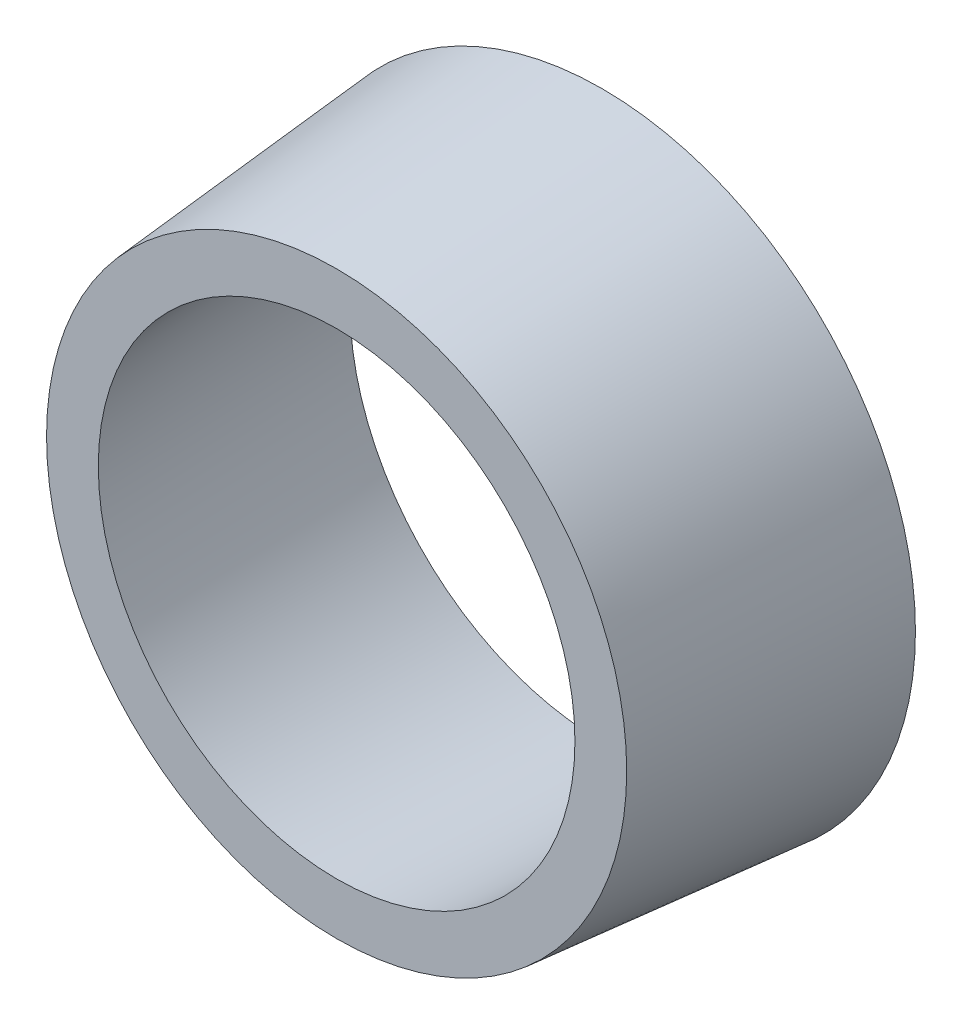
from build123d import *

# Parameters (mm, degrees)
ESQUISSE1_R             = 5.9
BOSS_EXTRU_1_DEPTH      = 5
BOSS_EXTRU_1_TAPER      = 5
ESQUISSE2_R             = 4.75
ENL_V_MAT_EXTRU_2_DEPTH = 10
ENL_V_MAT_EXTRU_2_DRAFT = -3


with BuildPart() as part:
    # Esquisse1 → Boss.-Extru.1 (new body)
    with BuildSketch(Plane.XY):
        Circle(ESQUISSE1_R)
    extrude(amount=BOSS_EXTRU_1_DEPTH, taper=BOSS_EXTRU_1_TAPER)


with BuildPart() as enl_v_mat_extru_2_tool:
    # Esquisse2 → Enl_v. mat.-Extru.2 (with draft: the straight prism first)
    with BuildSketch(Plane(origin=(0, 0, 0), x_dir=(-1, 0, 0), z_dir=(0, 0, -1))):
        Circle(ESQUISSE2_R)
    extrude(amount=-ENL_V_MAT_EXTRU_2_DEPTH)
    # Enl_v. mat.-Extru.2: the draft: its side faces are tilted about the plane it starts from
    enl_v_mat_extru_2_sides = [enl_v_mat_extru_2_tool.faces().sort_by_distance(p)[0] for p in [
        (4.75, 0, 5),
    ]]
    draft(enl_v_mat_extru_2_sides, Plane(origin=(0, 0, 0), x_dir=(-1, 0, 0), z_dir=(0, 0, -1)), ENL_V_MAT_EXTRU_2_DRAFT)


with BuildPart() as part_1:
    add(part.part)

    # Enl_v. mat.-Extru.2: cut by enl_v_mat_extru_2_tool
    add(enl_v_mat_extru_2_tool.part, mode=Mode.SUBTRACT)


solid = part_1.part
